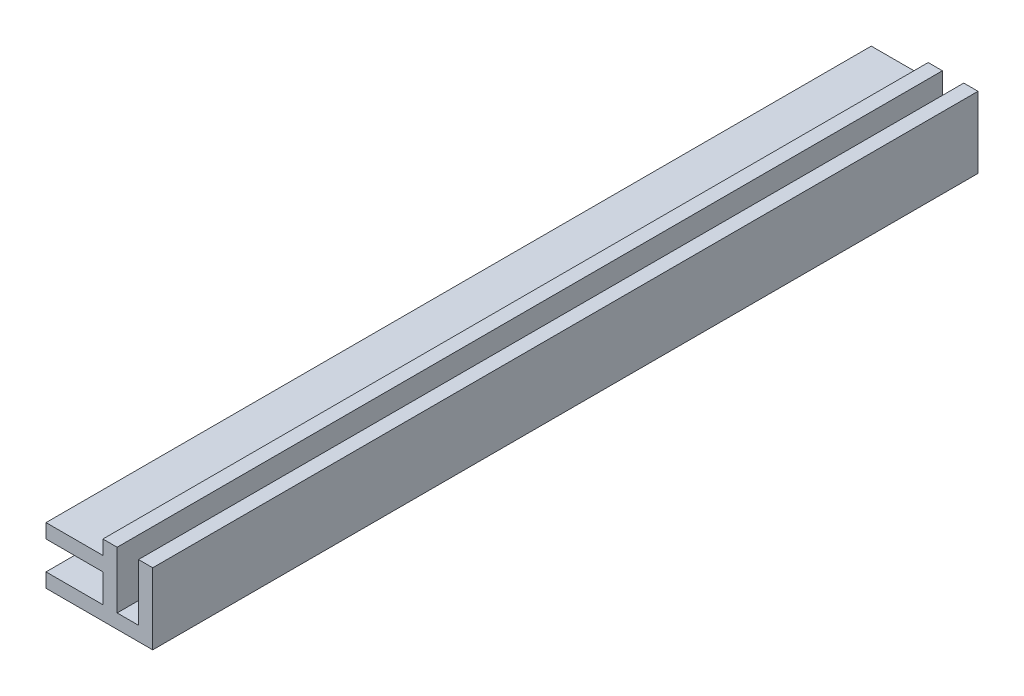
ISO-10303-21;
HEADER;
FILE_DESCRIPTION(('STEP AP214'),'2;1');
FILE_NAME('part.step','',(''),(''),'','','');
FILE_SCHEMA(('AUTOMOTIVE_DESIGN { 1 0 10303 214 1 1 1 1 }'));
ENDSEC;
DATA;
#1=APPLICATION_CONTEXT('core data for automotive mechanical design processes');
#2=APPLICATION_PROTOCOL_DEFINITION('international standard','automotive_design',2000,#1);
#3=PRODUCT_CONTEXT('',#1,'mechanical');
#4=PRODUCT('Part','Part','',(#3));
#5=PRODUCT_RELATED_PRODUCT_CATEGORY('part','',(#4));
#6=PRODUCT_DEFINITION_FORMATION('','',#4);
#7=PRODUCT_DEFINITION_CONTEXT('part definition',#1,'design');
#8=PRODUCT_DEFINITION('design','',#6,#7);
#9=PRODUCT_DEFINITION_SHAPE('','',#8);
#10=(LENGTH_UNIT() NAMED_UNIT(*) SI_UNIT(.MILLI.,.METRE.));
#11=(NAMED_UNIT(*) PLANE_ANGLE_UNIT() SI_UNIT($,.RADIAN.));
#12=(NAMED_UNIT(*) SI_UNIT($,.STERADIAN.) SOLID_ANGLE_UNIT());
#13=UNCERTAINTY_MEASURE_WITH_UNIT(LENGTH_MEASURE(1.E-05),#10,'distance_accuracy_value','');
#14=(GEOMETRIC_REPRESENTATION_CONTEXT(3) GLOBAL_UNCERTAINTY_ASSIGNED_CONTEXT((#13)) GLOBAL_UNIT_ASSIGNED_CONTEXT((#10,
#11,#12)) REPRESENTATION_CONTEXT('',''));
#15=CARTESIAN_POINT('',(0.,0.,0.));
#16=DIRECTION('',(0.,0.,1.));
#17=DIRECTION('',(1.,0.,0.));
#18=AXIS2_PLACEMENT_3D('',#15,#16,#17);
#19=CARTESIAN_POINT('',(0.,10.,116.));
#20=DIRECTION('',(0.,-1.,0.));
#21=DIRECTION('',(0.,0.,-1.));
#22=AXIS2_PLACEMENT_3D('',#19,#20,#21);
#23=PLANE('',#22);
#24=DIRECTION('',(-1.,0.,0.));
#25=VECTOR('',#24,1.);
#26=CARTESIAN_POINT('',(0.,10.,116.));
#27=LINE('',#26,#25);
#28=CARTESIAN_POINT('',(10.,10.,116.));
#29=VERTEX_POINT('',#28);
#30=CARTESIAN_POINT('',(8.,10.,116.));
#31=VERTEX_POINT('',#30);
#32=EDGE_CURVE('E225',#29,#31,#27,.T.);
#33=ORIENTED_EDGE('',*,*,#32,.F.);
#34=DIRECTION('',(0.,0.,1.));
#35=VECTOR('',#34,1.);
#36=CARTESIAN_POINT('',(10.,10.,0.));
#37=LINE('',#36,#35);
#38=CARTESIAN_POINT('',(10.,10.,0.));
#39=VERTEX_POINT('',#38);
#40=EDGE_CURVE('E144',#39,#29,#37,.T.);
#41=ORIENTED_EDGE('',*,*,#40,.F.);
#42=DIRECTION('',(-1.,0.,0.));
#43=VECTOR('',#42,1.);
#44=CARTESIAN_POINT('',(0.,10.,0.));
#45=LINE('',#44,#43);
#46=CARTESIAN_POINT('',(8.,10.,0.));
#47=VERTEX_POINT('',#46);
#48=EDGE_CURVE('E214',#39,#47,#45,.T.);
#49=ORIENTED_EDGE('',*,*,#48,.T.);
#50=DIRECTION('',(0.,0.,1.));
#51=VECTOR('',#50,1.);
#52=CARTESIAN_POINT('',(8.,10.,0.));
#53=LINE('',#52,#51);
#54=EDGE_CURVE('E174',#47,#31,#53,.T.);
#55=ORIENTED_EDGE('',*,*,#54,.T.);
#56=EDGE_LOOP('',(#33,#41,#49,#55));
#57=FACE_BOUND('',#56,.T.);
#58=ADVANCED_FACE('F26',(#57),#23,.F.);
#59=CARTESIAN_POINT('',(0.,0.,116.));
#60=DIRECTION('',(1.,0.,0.));
#61=DIRECTION('',(0.,0.,-1.));
#62=AXIS2_PLACEMENT_3D('',#59,#60,#61);
#63=PLANE('',#62);
#64=DIRECTION('',(0.,-1.,0.));
#65=VECTOR('',#64,1.);
#66=CARTESIAN_POINT('',(0.,0.,116.));
#67=LINE('',#66,#65);
#68=CARTESIAN_POINT('',(0.,8.,116.));
#69=VERTEX_POINT('',#68);
#70=CARTESIAN_POINT('',(0.,6.,116.));
#71=VERTEX_POINT('',#70);
#72=EDGE_CURVE('E219',#69,#71,#67,.T.);
#73=ORIENTED_EDGE('',*,*,#72,.F.);
#74=DIRECTION('',(0.,0.,1.));
#75=VECTOR('',#74,1.);
#76=CARTESIAN_POINT('',(0.,8.,0.));
#77=LINE('',#76,#75);
#78=CARTESIAN_POINT('',(0.,8.,0.));
#79=VERTEX_POINT('',#78);
#80=EDGE_CURVE('E173',#79,#69,#77,.T.);
#81=ORIENTED_EDGE('',*,*,#80,.F.);
#82=DIRECTION('',(0.,-1.,0.));
#83=VECTOR('',#82,1.);
#84=CARTESIAN_POINT('',(0.,0.,0.));
#85=LINE('',#84,#83);
#86=CARTESIAN_POINT('',(0.,6.,0.));
#87=VERTEX_POINT('',#86);
#88=EDGE_CURVE('E208',#79,#87,#85,.T.);
#89=ORIENTED_EDGE('',*,*,#88,.T.);
#90=DIRECTION('',(0.,0.,1.));
#91=VECTOR('',#90,1.);
#92=CARTESIAN_POINT('',(0.,6.,0.));
#93=LINE('',#92,#91);
#94=EDGE_CURVE('E199',#87,#71,#93,.T.);
#95=ORIENTED_EDGE('',*,*,#94,.T.);
#96=EDGE_LOOP('',(#73,#81,#89,#95));
#97=FACE_BOUND('',#96,.T.);
#98=ADVANCED_FACE('F268',(#97),#63,.F.);
#99=CARTESIAN_POINT('',(0.,2.,116.));
#100=VERTEX_POINT('',#99);
#101=CARTESIAN_POINT('',(0.,0.,116.));
#102=VERTEX_POINT('',#101);
#103=EDGE_CURVE('E218',#100,#102,#67,.T.);
#104=ORIENTED_EDGE('',*,*,#103,.F.);
#105=DIRECTION('',(0.,0.,1.));
#106=VECTOR('',#105,1.);
#107=CARTESIAN_POINT('',(0.,2.,0.));
#108=LINE('',#107,#106);
#109=CARTESIAN_POINT('',(0.,2.,0.));
#110=VERTEX_POINT('',#109);
#111=EDGE_CURVE('E198',#110,#100,#108,.T.);
#112=ORIENTED_EDGE('',*,*,#111,.F.);
#113=CARTESIAN_POINT('',(0.,0.,0.));
#114=VERTEX_POINT('',#113);
#115=EDGE_CURVE('E202',#110,#114,#85,.T.);
#116=ORIENTED_EDGE('',*,*,#115,.T.);
#117=DIRECTION('',(0.,0.,-1.));
#118=VECTOR('',#117,1.);
#119=CARTESIAN_POINT('',(0.,0.,116.));
#120=LINE('',#119,#118);
#121=EDGE_CURVE('E11',#102,#114,#120,.T.);
#122=ORIENTED_EDGE('',*,*,#121,.F.);
#123=EDGE_LOOP('',(#104,#112,#116,#122));
#124=FACE_BOUND('',#123,.T.);
#125=ADVANCED_FACE('F28',(#124),#63,.F.);
#126=CARTESIAN_POINT('',(0.,0.,116.));
#127=DIRECTION('',(0.,1.,0.));
#128=DIRECTION('',(0.,0.,1.));
#129=AXIS2_PLACEMENT_3D('',#126,#127,#128);
#130=PLANE('',#129);
#131=DIRECTION('',(1.,0.,0.));
#132=VECTOR('',#131,1.);
#133=CARTESIAN_POINT('',(0.,0.,0.));
#134=LINE('',#133,#132);
#135=CARTESIAN_POINT('',(15.,0.,0.));
#136=VERTEX_POINT('',#135);
#137=EDGE_CURVE('E210',#114,#136,#134,.T.);
#138=ORIENTED_EDGE('',*,*,#137,.T.);
#139=DIRECTION('',(0.,0.,-1.));
#140=VECTOR('',#139,1.);
#141=CARTESIAN_POINT('',(15.,0.,116.));
#142=LINE('',#141,#140);
#143=CARTESIAN_POINT('',(15.,0.,116.));
#144=VERTEX_POINT('',#143);
#145=EDGE_CURVE('E34',#144,#136,#142,.T.);
#146=ORIENTED_EDGE('',*,*,#145,.F.);
#147=DIRECTION('',(1.,0.,0.));
#148=VECTOR('',#147,1.);
#149=CARTESIAN_POINT('',(0.,0.,116.));
#150=LINE('',#149,#148);
#151=EDGE_CURVE('E221',#102,#144,#150,.T.);
#152=ORIENTED_EDGE('',*,*,#151,.F.);
#153=ORIENTED_EDGE('',*,*,#121,.T.);
#154=EDGE_LOOP('',(#138,#146,#152,#153));
#155=FACE_BOUND('',#154,.T.);
#156=ADVANCED_FACE('F250',(#155),#130,.F.);
#157=CARTESIAN_POINT('',(15.,0.,116.));
#158=DIRECTION('',(-1.,0.,0.));
#159=DIRECTION('',(0.,0.,1.));
#160=AXIS2_PLACEMENT_3D('',#157,#158,#159);
#161=PLANE('',#160);
#162=DIRECTION('',(0.,1.,0.));
#163=VECTOR('',#162,1.);
#164=CARTESIAN_POINT('',(15.,0.,0.));
#165=LINE('',#164,#163);
#166=CARTESIAN_POINT('',(15.,10.,0.));
#167=VERTEX_POINT('',#166);
#168=EDGE_CURVE('E212',#136,#167,#165,.T.);
#169=ORIENTED_EDGE('',*,*,#168,.T.);
#170=DIRECTION('',(0.,0.,-1.));
#171=VECTOR('',#170,1.);
#172=CARTESIAN_POINT('',(15.,10.,116.));
#173=LINE('',#172,#171);
#174=CARTESIAN_POINT('',(15.,10.,116.));
#175=VERTEX_POINT('',#174);
#176=EDGE_CURVE('E228',#175,#167,#173,.T.);
#177=ORIENTED_EDGE('',*,*,#176,.F.);
#178=DIRECTION('',(0.,1.,0.));
#179=VECTOR('',#178,1.);
#180=CARTESIAN_POINT('',(15.,0.,116.));
#181=LINE('',#180,#179);
#182=EDGE_CURVE('E223',#144,#175,#181,.T.);
#183=ORIENTED_EDGE('',*,*,#182,.F.);
#184=ORIENTED_EDGE('',*,*,#145,.T.);
#185=EDGE_LOOP('',(#169,#177,#183,#184));
#186=FACE_BOUND('',#185,.T.);
#187=ADVANCED_FACE('F235',(#186),#161,.F.);
#188=CARTESIAN_POINT('',(13.,10.,0.));
#189=VERTEX_POINT('',#188);
#190=EDGE_CURVE('E215',#167,#189,#45,.T.);
#191=ORIENTED_EDGE('',*,*,#190,.T.);
#192=DIRECTION('',(0.,0.,1.));
#193=VECTOR('',#192,1.);
#194=CARTESIAN_POINT('',(13.,10.,0.));
#195=LINE('',#194,#193);
#196=CARTESIAN_POINT('',(13.,10.,116.));
#197=VERTEX_POINT('',#196);
#198=EDGE_CURVE('E160',#189,#197,#195,.T.);
#199=ORIENTED_EDGE('',*,*,#198,.T.);
#200=EDGE_CURVE('E226',#175,#197,#27,.T.);
#201=ORIENTED_EDGE('',*,*,#200,.F.);
#202=ORIENTED_EDGE('',*,*,#176,.T.);
#203=EDGE_LOOP('',(#191,#199,#201,#202));
#204=FACE_BOUND('',#203,.T.);
#205=ADVANCED_FACE('F245',(#204),#23,.F.);
#206=CARTESIAN_POINT('',(0.,10.,116.));
#207=DIRECTION('',(0.,0.,-1.));
#208=DIRECTION('',(-1.,0.,0.));
#209=AXIS2_PLACEMENT_3D('',#206,#207,#208);
#210=PLANE('',#209);
#211=DIRECTION('',(1.,0.,0.));
#212=VECTOR('',#211,1.);
#213=CARTESIAN_POINT('',(10.,2.,116.));
#214=LINE('',#213,#212);
#215=CARTESIAN_POINT('',(10.,2.,116.));
#216=VERTEX_POINT('',#215);
#217=CARTESIAN_POINT('',(13.,2.,116.));
#218=VERTEX_POINT('',#217);
#219=EDGE_CURVE('E132',#216,#218,#214,.T.);
#220=ORIENTED_EDGE('',*,*,#219,.F.);
#221=DIRECTION('',(0.,-1.,0.));
#222=VECTOR('',#221,1.);
#223=CARTESIAN_POINT('',(10.,10.,116.));
#224=LINE('',#223,#222);
#225=EDGE_CURVE('E141',#29,#216,#224,.T.);
#226=ORIENTED_EDGE('',*,*,#225,.F.);
#227=ORIENTED_EDGE('',*,*,#32,.T.);
#228=DIRECTION('',(0.,1.,0.));
#229=VECTOR('',#228,1.);
#230=CARTESIAN_POINT('',(8.,10.,116.));
#231=LINE('',#230,#229);
#232=CARTESIAN_POINT('',(8.,8.,116.));
#233=VERTEX_POINT('',#232);
#234=EDGE_CURVE('E166',#233,#31,#231,.T.);
#235=ORIENTED_EDGE('',*,*,#234,.F.);
#236=DIRECTION('',(1.,0.,0.));
#237=VECTOR('',#236,1.);
#238=CARTESIAN_POINT('',(0.,8.,116.));
#239=LINE('',#238,#237);
#240=EDGE_CURVE('E159',#69,#233,#239,.T.);
#241=ORIENTED_EDGE('',*,*,#240,.F.);
#242=ORIENTED_EDGE('',*,*,#72,.T.);
#243=DIRECTION('',(-1.,0.,0.));
#244=VECTOR('',#243,1.);
#245=CARTESIAN_POINT('',(0.,6.,116.));
#246=LINE('',#245,#244);
#247=CARTESIAN_POINT('',(8.,6.,116.));
#248=VERTEX_POINT('',#247);
#249=EDGE_CURVE('E186',#248,#71,#246,.T.);
#250=ORIENTED_EDGE('',*,*,#249,.F.);
#251=DIRECTION('',(0.,1.,0.));
#252=VECTOR('',#251,1.);
#253=CARTESIAN_POINT('',(8.,6.,116.));
#254=LINE('',#253,#252);
#255=CARTESIAN_POINT('',(8.,2.,116.));
#256=VERTEX_POINT('',#255);
#257=EDGE_CURVE('E183',#256,#248,#254,.T.);
#258=ORIENTED_EDGE('',*,*,#257,.F.);
#259=DIRECTION('',(1.,0.,0.));
#260=VECTOR('',#259,1.);
#261=CARTESIAN_POINT('',(0.,2.,116.));
#262=LINE('',#261,#260);
#263=EDGE_CURVE('E177',#100,#256,#262,.T.);
#264=ORIENTED_EDGE('',*,*,#263,.F.);
#265=ORIENTED_EDGE('',*,*,#103,.T.);
#266=ORIENTED_EDGE('',*,*,#151,.T.);
#267=ORIENTED_EDGE('',*,*,#182,.T.);
#268=ORIENTED_EDGE('',*,*,#200,.T.);
#269=DIRECTION('',(0.,1.,0.));
#270=VECTOR('',#269,1.);
#271=CARTESIAN_POINT('',(13.,10.,116.));
#272=LINE('',#271,#270);
#273=EDGE_CURVE('E150',#218,#197,#272,.T.);
#274=ORIENTED_EDGE('',*,*,#273,.F.);
#275=EDGE_LOOP('',(#220,#226,#227,#235,#241,#242,#250,#258,#264,#265,#266,#267,#268,#274));
#276=FACE_BOUND('',#275,.T.);
#277=ADVANCED_FACE('F148',(#276),#210,.F.);
#278=CARTESIAN_POINT('',(0.,10.,0.));
#279=DIRECTION('',(0.,0.,-1.));
#280=DIRECTION('',(-1.,0.,0.));
#281=AXIS2_PLACEMENT_3D('',#278,#279,#280);
#282=PLANE('',#281);
#283=DIRECTION('',(0.,-1.,0.));
#284=VECTOR('',#283,1.);
#285=CARTESIAN_POINT('',(10.,10.,0.));
#286=LINE('',#285,#284);
#287=CARTESIAN_POINT('',(10.,2.,0.));
#288=VERTEX_POINT('',#287);
#289=EDGE_CURVE('E152',#39,#288,#286,.T.);
#290=ORIENTED_EDGE('',*,*,#289,.T.);
#291=DIRECTION('',(1.,0.,0.));
#292=VECTOR('',#291,1.);
#293=CARTESIAN_POINT('',(10.,2.,0.));
#294=LINE('',#293,#292);
#295=CARTESIAN_POINT('',(13.,2.,0.));
#296=VERTEX_POINT('',#295);
#297=EDGE_CURVE('E135',#288,#296,#294,.T.);
#298=ORIENTED_EDGE('',*,*,#297,.T.);
#299=DIRECTION('',(0.,1.,0.));
#300=VECTOR('',#299,1.);
#301=CARTESIAN_POINT('',(13.,10.,0.));
#302=LINE('',#301,#300);
#303=EDGE_CURVE('E41',#296,#189,#302,.T.);
#304=ORIENTED_EDGE('',*,*,#303,.T.);
#305=ORIENTED_EDGE('',*,*,#190,.F.);
#306=ORIENTED_EDGE('',*,*,#168,.F.);
#307=ORIENTED_EDGE('',*,*,#137,.F.);
#308=ORIENTED_EDGE('',*,*,#115,.F.);
#309=DIRECTION('',(1.,0.,0.));
#310=VECTOR('',#309,1.);
#311=CARTESIAN_POINT('',(0.,2.,0.));
#312=LINE('',#311,#310);
#313=CARTESIAN_POINT('',(8.,2.,0.));
#314=VERTEX_POINT('',#313);
#315=EDGE_CURVE('E189',#110,#314,#312,.T.);
#316=ORIENTED_EDGE('',*,*,#315,.T.);
#317=DIRECTION('',(0.,1.,0.));
#318=VECTOR('',#317,1.);
#319=CARTESIAN_POINT('',(8.,6.,0.));
#320=LINE('',#319,#318);
#321=CARTESIAN_POINT('',(8.,6.,0.));
#322=VERTEX_POINT('',#321);
#323=EDGE_CURVE('E192',#314,#322,#320,.T.);
#324=ORIENTED_EDGE('',*,*,#323,.T.);
#325=DIRECTION('',(-1.,0.,0.));
#326=VECTOR('',#325,1.);
#327=CARTESIAN_POINT('',(0.,6.,0.));
#328=LINE('',#327,#326);
#329=EDGE_CURVE('E195',#322,#87,#328,.T.);
#330=ORIENTED_EDGE('',*,*,#329,.T.);
#331=ORIENTED_EDGE('',*,*,#88,.F.);
#332=DIRECTION('',(1.,0.,0.));
#333=VECTOR('',#332,1.);
#334=CARTESIAN_POINT('',(0.,8.,0.));
#335=LINE('',#334,#333);
#336=CARTESIAN_POINT('',(8.,8.,0.));
#337=VERTEX_POINT('',#336);
#338=EDGE_CURVE('E169',#79,#337,#335,.T.);
#339=ORIENTED_EDGE('',*,*,#338,.T.);
#340=DIRECTION('',(0.,1.,0.));
#341=VECTOR('',#340,1.);
#342=CARTESIAN_POINT('',(8.,10.,0.));
#343=LINE('',#342,#341);
#344=EDGE_CURVE('E49',#337,#47,#343,.T.);
#345=ORIENTED_EDGE('',*,*,#344,.T.);
#346=ORIENTED_EDGE('',*,*,#48,.F.);
#347=EDGE_LOOP('',(#290,#298,#304,#305,#306,#307,#308,#316,#324,#330,#331,#339,#345,#346));
#348=FACE_BOUND('',#347,.T.);
#349=ADVANCED_FACE('F242',(#348),#282,.T.);
#350=CARTESIAN_POINT('',(0.,6.,0.));
#351=DIRECTION('',(0.,1.,0.));
#352=DIRECTION('',(0.,0.,1.));
#353=AXIS2_PLACEMENT_3D('',#350,#351,#352);
#354=PLANE('',#353);
#355=ORIENTED_EDGE('',*,*,#249,.T.);
#356=ORIENTED_EDGE('',*,*,#94,.F.);
#357=ORIENTED_EDGE('',*,*,#329,.F.);
#358=DIRECTION('',(0.,0.,1.));
#359=VECTOR('',#358,1.);
#360=CARTESIAN_POINT('',(8.,6.,0.));
#361=LINE('',#360,#359);
#362=EDGE_CURVE('E203',#322,#248,#361,.T.);
#363=ORIENTED_EDGE('',*,*,#362,.T.);
#364=EDGE_LOOP('',(#355,#356,#357,#363));
#365=FACE_BOUND('',#364,.T.);
#366=ADVANCED_FACE('F263',(#365),#354,.F.);
#367=CARTESIAN_POINT('',(8.,6.,0.));
#368=DIRECTION('',(1.,0.,0.));
#369=DIRECTION('',(0.,0.,-1.));
#370=AXIS2_PLACEMENT_3D('',#367,#368,#369);
#371=PLANE('',#370);
#372=ORIENTED_EDGE('',*,*,#257,.T.);
#373=ORIENTED_EDGE('',*,*,#362,.F.);
#374=ORIENTED_EDGE('',*,*,#323,.F.);
#375=DIRECTION('',(0.,0.,1.));
#376=VECTOR('',#375,1.);
#377=CARTESIAN_POINT('',(8.,2.,0.));
#378=LINE('',#377,#376);
#379=EDGE_CURVE('E205',#314,#256,#378,.T.);
#380=ORIENTED_EDGE('',*,*,#379,.T.);
#381=EDGE_LOOP('',(#372,#373,#374,#380));
#382=FACE_BOUND('',#381,.T.);
#383=ADVANCED_FACE('F258',(#382),#371,.F.);
#384=CARTESIAN_POINT('',(0.,2.,0.));
#385=DIRECTION('',(0.,-1.,0.));
#386=DIRECTION('',(0.,0.,-1.));
#387=AXIS2_PLACEMENT_3D('',#384,#385,#386);
#388=PLANE('',#387);
#389=ORIENTED_EDGE('',*,*,#263,.T.);
#390=ORIENTED_EDGE('',*,*,#379,.F.);
#391=ORIENTED_EDGE('',*,*,#315,.F.);
#392=ORIENTED_EDGE('',*,*,#111,.T.);
#393=EDGE_LOOP('',(#389,#390,#391,#392));
#394=FACE_BOUND('',#393,.T.);
#395=ADVANCED_FACE('F255',(#394),#388,.F.);
#396=CARTESIAN_POINT('',(8.,10.,0.));
#397=DIRECTION('',(1.,0.,0.));
#398=DIRECTION('',(0.,0.,-1.));
#399=AXIS2_PLACEMENT_3D('',#396,#397,#398);
#400=PLANE('',#399);
#401=ORIENTED_EDGE('',*,*,#234,.T.);
#402=ORIENTED_EDGE('',*,*,#54,.F.);
#403=ORIENTED_EDGE('',*,*,#344,.F.);
#404=DIRECTION('',(0.,0.,1.));
#405=VECTOR('',#404,1.);
#406=CARTESIAN_POINT('',(8.,8.,0.));
#407=LINE('',#406,#405);
#408=EDGE_CURVE('E178',#337,#233,#407,.T.);
#409=ORIENTED_EDGE('',*,*,#408,.T.);
#410=EDGE_LOOP('',(#401,#402,#403,#409));
#411=FACE_BOUND('',#410,.T.);
#412=ADVANCED_FACE('F273',(#411),#400,.F.);
#413=CARTESIAN_POINT('',(0.,8.,0.));
#414=DIRECTION('',(0.,-1.,0.));
#415=DIRECTION('',(0.,0.,-1.));
#416=AXIS2_PLACEMENT_3D('',#413,#414,#415);
#417=PLANE('',#416);
#418=ORIENTED_EDGE('',*,*,#240,.T.);
#419=ORIENTED_EDGE('',*,*,#408,.F.);
#420=ORIENTED_EDGE('',*,*,#338,.F.);
#421=ORIENTED_EDGE('',*,*,#80,.T.);
#422=EDGE_LOOP('',(#418,#419,#420,#421));
#423=FACE_BOUND('',#422,.T.);
#424=ADVANCED_FACE('F271',(#423),#417,.F.);
#425=CARTESIAN_POINT('',(10.,10.,0.));
#426=DIRECTION('',(-1.,0.,0.));
#427=DIRECTION('',(0.,0.,1.));
#428=AXIS2_PLACEMENT_3D('',#425,#426,#427);
#429=PLANE('',#428);
#430=ORIENTED_EDGE('',*,*,#225,.T.);
#431=DIRECTION('',(0.,0.,1.));
#432=VECTOR('',#431,1.);
#433=CARTESIAN_POINT('',(10.,2.,0.));
#434=LINE('',#433,#432);
#435=EDGE_CURVE('E128',#288,#216,#434,.T.);
#436=ORIENTED_EDGE('',*,*,#435,.F.);
#437=ORIENTED_EDGE('',*,*,#289,.F.);
#438=ORIENTED_EDGE('',*,*,#40,.T.);
#439=EDGE_LOOP('',(#430,#436,#437,#438));
#440=FACE_BOUND('',#439,.T.);
#441=ADVANCED_FACE('F142',(#440),#429,.F.);
#442=CARTESIAN_POINT('',(13.,10.,0.));
#443=DIRECTION('',(1.,0.,0.));
#444=DIRECTION('',(0.,0.,-1.));
#445=AXIS2_PLACEMENT_3D('',#442,#443,#444);
#446=PLANE('',#445);
#447=ORIENTED_EDGE('',*,*,#273,.T.);
#448=ORIENTED_EDGE('',*,*,#198,.F.);
#449=ORIENTED_EDGE('',*,*,#303,.F.);
#450=DIRECTION('',(0.,0.,1.));
#451=VECTOR('',#450,1.);
#452=CARTESIAN_POINT('',(13.,2.,0.));
#453=LINE('',#452,#451);
#454=EDGE_CURVE('E138',#296,#218,#453,.T.);
#455=ORIENTED_EDGE('',*,*,#454,.T.);
#456=EDGE_LOOP('',(#447,#448,#449,#455));
#457=FACE_BOUND('',#456,.T.);
#458=ADVANCED_FACE('F340',(#457),#446,.F.);
#459=CARTESIAN_POINT('',(10.,2.,0.));
#460=DIRECTION('',(0.,-1.,0.));
#461=DIRECTION('',(0.,0.,-1.));
#462=AXIS2_PLACEMENT_3D('',#459,#460,#461);
#463=PLANE('',#462);
#464=ORIENTED_EDGE('',*,*,#219,.T.);
#465=ORIENTED_EDGE('',*,*,#454,.F.);
#466=ORIENTED_EDGE('',*,*,#297,.F.);
#467=ORIENTED_EDGE('',*,*,#435,.T.);
#468=EDGE_LOOP('',(#464,#465,#466,#467));
#469=FACE_BOUND('',#468,.T.);
#470=ADVANCED_FACE('F130',(#469),#463,.F.);
#471=CLOSED_SHELL('',(#58,#98,#125,#156,#187,#205,#277,#349,#366,#383,#395,#412,#424,#441,#458,#470));
#472=MANIFOLD_SOLID_BREP('B2',#471);
#473=ADVANCED_BREP_SHAPE_REPRESENTATION('',(#18,#472),#14);
#474=SHAPE_DEFINITION_REPRESENTATION(#9,#473);
ENDSEC;
END-ISO-10303-21;
